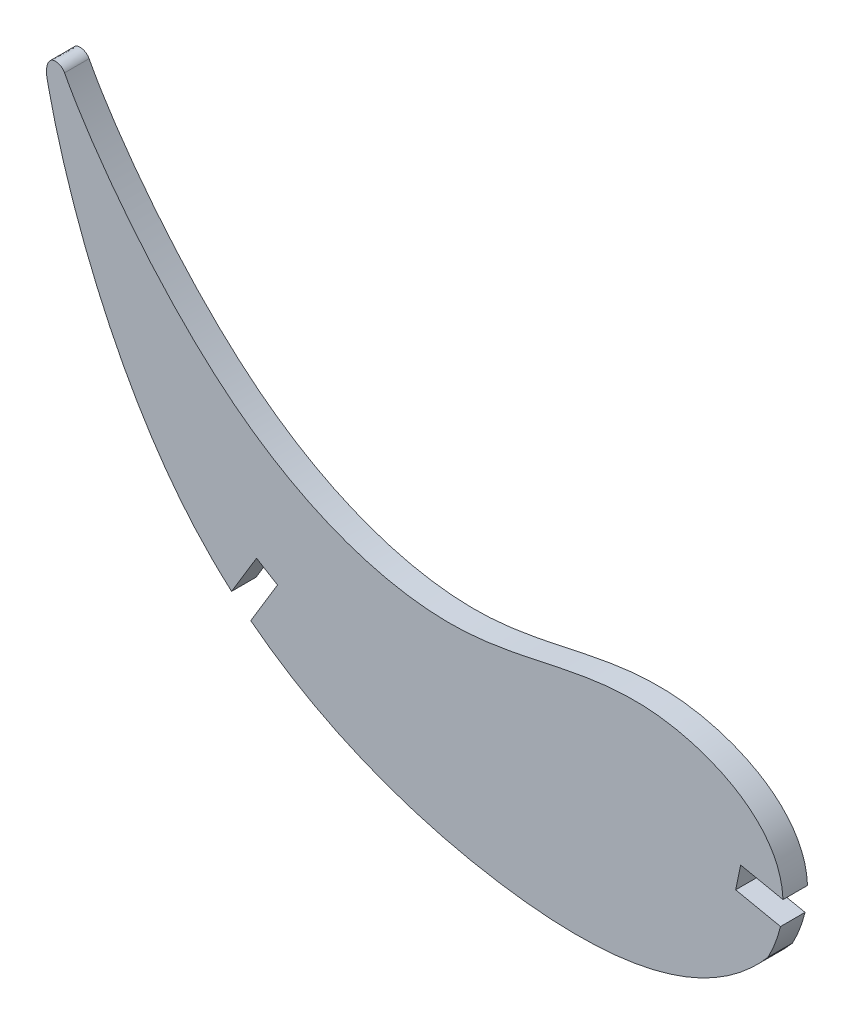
from build123d import *

# Parameters (mm, degrees)
AUFSATZ_LINEAR_AUSTRAGEN1_DEPTH = 1.5875


with BuildPart() as part:
    # Skizze1 → Aufsatz-Linear austragen1 (new, symmetric)
    with BuildSketch(Plane.XY):
        with BuildLine():
            Line((-35.738362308, 6.168041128), (-38.965380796, 0.838986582))
            add(Edge.make_bspline(
                [(-38.965380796, 0.838986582), (-40.505605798, 2.188879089), (-53.278885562, 14.701396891), (-60.339367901, 34.807570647), (-62.65578316, 45.457503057)],
                knots=[18.869254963, 18.869254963, 18.869254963, 18.869254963, 19, 20, 20, 20, 20], degree=3))
            add(Edge.make_bspline(
                [(-62.65578316, 45.457503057), (-62.777610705, 46.064644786), (-63.132517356, 47.264784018), (-62.420123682, 49.250549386), (-60.861773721, 48.716248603), (-60.58635179, 48.150585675)],
                knots=[20, 20, 20, 20, 21, 22, 23, 23, 23, 23], degree=3))
            add(Edge.make_bspline(
                [(-60.58635179, 48.150585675), (-57.268746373, 41.768710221), (-39.851542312, 17.985258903), (-8.378247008, 7.678892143), (13.347607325, 18.740357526), (32.117519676, 9.524560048), (32.402841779, 1.970462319)],
                knots=[23, 23, 23, 23, 24, 25, 26, 26.775937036, 26.775937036, 26.775937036, 26.775937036], degree=3))
            Line((32.402841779, 1.970462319), (26.918755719, 3.10874174))
            Line((26.918755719, 3.10874174), (26.273503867, 5.2e-08))
            Line((26.273503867, 5.2e-08), (32.081888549, -1.20559094))
            add(Edge.make_bspline(
                [(32.081888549, -1.20559094), (31.541673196, -3.439683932), (30.456914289, -5.466085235)],
                knots=[0, 0, 0, 0.18000661, 0.18000661, 0.18000661], degree=2, weights=[1, 0.99193074, 1]))
            add(Edge.make_bspline(
                [(30.456914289, -5.466085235), (22.488384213, -14.797397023), (0.160896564, -18.09905328), (-26.674899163, -8.857739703), (-36.491724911, -1.20559094)],
                knots=[27.476659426, 27.476659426, 27.476659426, 27.476659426, 28.476659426, 29.277344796, 29.277344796, 29.277344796, 29.277344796], degree=3))
            Line((-36.491724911, -1.20559094), (-33.022497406, 4.523444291))
            Line((-33.022497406, 4.523444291), (-35.738362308, 6.168041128))
        make_face()
    extrude(amount=AUFSATZ_LINEAR_AUSTRAGEN1_DEPTH, both=True)


solid = part.part
